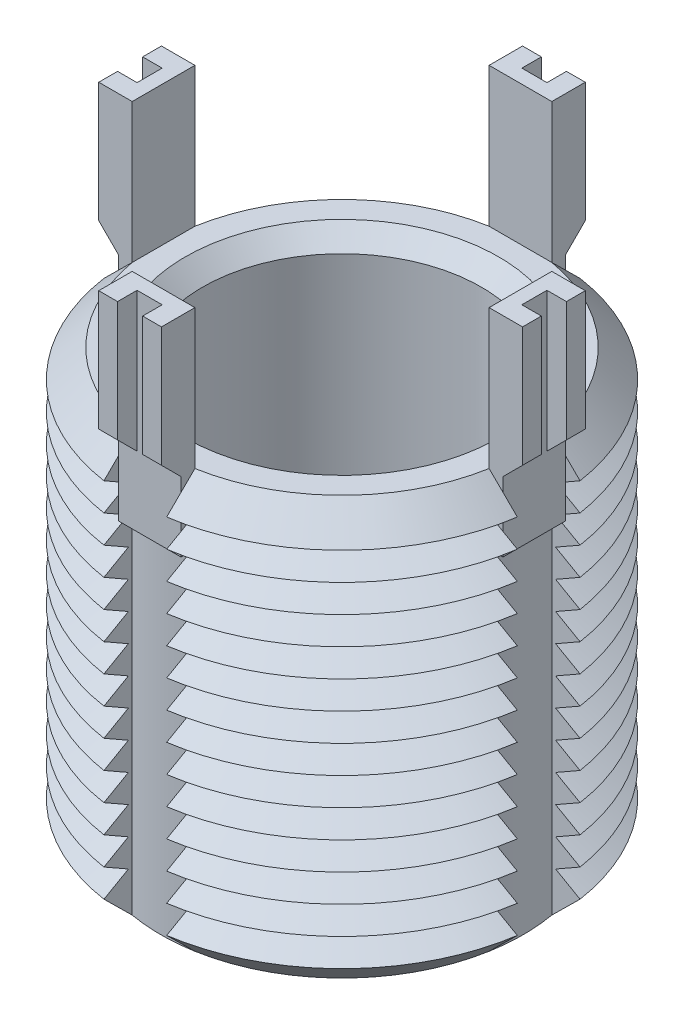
from build123d import *

# Parameters (mm, degrees)
SKETCH1_R               = 15
BOSS_EXTRUDE1_DEPTH     = 30
CHAMFER1_SIZE           = 2
LPATTERN1_COUNT         = 13
LPATTERN1_PITCH         = 2
CUT_EXTRUDE1_REACH      = 38.742
CIRPATTERN1_COUNT       = 4
BOSS_EXTRUDE3_DEPTH     = 2.25
CIRPATTERN2_COUNT       = 4
CUT_EXTRUDE3_DEPTH      = 46.412680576
CUT_EXTRUDE3_DEPTH_BACK = 46.412680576
SKETCH6_W               = 1.4
SKETCH6_H               = 1.8
SKETCH6_W_2             = 1.8
SKETCH6_H_2             = 1.4
SKETCH7_R               = 10
CUT_EXTRUDE4_DEPTH      = 30
CHAMFER2_SIZE           = 1.25


with BuildPart() as part:
    # Sketch1 → Boss-Extrude1 (new body)
    with BuildSketch(Plane(origin=(0, 0, 0), x_dir=(1, 0, 0), z_dir=(0, 1, 0))):
        with Locations(Location((0, 0, 0), (0, 0, 270))):
            Circle(SKETCH1_R)
    extrude(amount=-BOSS_EXTRUDE1_DEPTH)

    # Chamfer1
    chamfer1_edges = [part.edges().sort_by_distance(p)[0] for p in [
        (0, 0, -15),
        (0, -30, -15),
    ]]
    chamfer(chamfer1_edges, length=CHAMFER1_SIZE)

    # Sketch3 → Cut-Revolve1 (revolve, cut)
    with BuildSketch(Plane(origin=(0, 0, 0), x_dir=(0, 0, -1), z_dir=(1, 0, 0))):
        Polygon((-15, -2), (-13.267949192, -3), (-15, -4), align=None)
    cut_revolve1 = revolve(axis=Axis((0, 0.885892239, 0), (0, -1, 0)), mode=Mode.SUBTRACT)

    # LPattern1: Cut-Revolve1 ×13
    with Locations(*[(0, -i * LPATTERN1_PITCH, 0) for i in range(1, LPATTERN1_COUNT)]):
        add(cut_revolve1, mode=Mode.SUBTRACT)

    # Cut-Extrude1: up to this cone (the profile starts inside it)
    cut_extrude1_end = Plane(origin=(0, 0, 0), z_dir=(0, 1, 0)).offset(-42.999999) * Cone(1e-06, 125.242, 125.241999, align=(Align.CENTER, Align.CENTER, Align.MIN), mode=Mode.PRIVATE)
    # Sketch4 → Cut-Extrude1 (cut, up to the surface)
    with BuildSketch(Plane(origin=(0, 0, 0), x_dir=(1, 0, 0), z_dir=(0, 1, 0)), mode=Mode.PRIVATE) as cut_extrude1_sk1:
        with BuildLine():
            Line((-12.803808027, 2.25), (-14.83028995, 2.25))
            ThreePointArc((-14.83028995, 2.25), (-15, 0), (-14.83028995, -2.25))
            Line((-14.83028995, -2.25), (-12.803808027, -2.25))
            ThreePointArc((-12.803808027, -2.25), (-13, 0), (-12.803808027, 2.25))
        make_face()
    cut_extrude1_tool1 = extrude(cut_extrude1_sk1.sketch, amount=-CUT_EXTRUDE1_REACH, mode=Mode.PRIVATE) & cut_extrude1_end
    cut_extrude1 = cut_extrude1_tool1.solids().sort_by_distance((-13.938966, 0, 0))[0]
    add(cut_extrude1, mode=Mode.SUBTRACT)

    # CirPattern1: Cut-Extrude1 ×4 about axis
    cirpattern1_axis = Axis((0, 0, 0), (0, 1, 0))
    for i in range(1, CIRPATTERN1_COUNT):
        add(cut_extrude1.rotate(cirpattern1_axis, i * 360 / CIRPATTERN1_COUNT), mode=Mode.SUBTRACT)

    # Sketch5 → Boss-Extrude3 (add, symmetric)
    with BuildSketch(Plane(origin=(0, 0, 0), x_dir=(0, 0, -1), z_dir=(1, 0, 0))):
        Polygon((-12.803808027, 10), (-12.803808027, -5), (-13.803808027, -5), (-13.803808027, 0), (-15.203808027, 1.4), (-15.203808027, 10), align=None)
    boss_extrude3 = extrude(amount=BOSS_EXTRUDE3_DEPTH, both=True)

    # CirPattern2: Boss-Extrude3 ×4 about axis
    cirpattern2_axis = Axis((0, 0, 0), (0, 1, 0))
    for i in range(1, CIRPATTERN2_COUNT):
        add(boss_extrude3.rotate(cirpattern2_axis, i * 360 / CIRPATTERN2_COUNT))

    # Sketch6 → Cut-Extrude3 (cut, two sides: drawn at the far end of the back side and taken through both)
    with BuildSketch(Plane(origin=(0, 10, 0), x_dir=(1, 0, 0), z_dir=(0, 1, 0)).offset(-CUT_EXTRUDE3_DEPTH_BACK)):
        with Locations((-14.503808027, 0)):
            Rectangle(SKETCH6_W, SKETCH6_H)
        with Locations((0, 14.503808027)):
            Rectangle(SKETCH6_W_2, SKETCH6_H_2)
        with Locations((14.503808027, 0)):
            Rectangle(SKETCH6_W, SKETCH6_H)
        with Locations((0, -14.503808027)):
            Rectangle(SKETCH6_W_2, SKETCH6_H_2)
    extrude(amount=CUT_EXTRUDE3_DEPTH + CUT_EXTRUDE3_DEPTH_BACK, mode=Mode.SUBTRACT)

    # Sketch7 → Cut-Extrude4 (cut)
    with BuildSketch(Plane(origin=(0, 0, 0), x_dir=(1, 0, 0), z_dir=(0, 1, 0))):
        with Locations(Location((0, 0, 0), (0, 0, 270))):
            Circle(SKETCH7_R)
    extrude(amount=-CUT_EXTRUDE4_DEPTH, mode=Mode.SUBTRACT)

    # Chamfer2
    chamfer2_edges = [part.edges().sort_by_distance(p)[0] for p in [
        (0, 0, -10),
        (0, -30, -10),
    ]]
    chamfer(chamfer2_edges, length=CHAMFER2_SIZE)


solid = part.part
